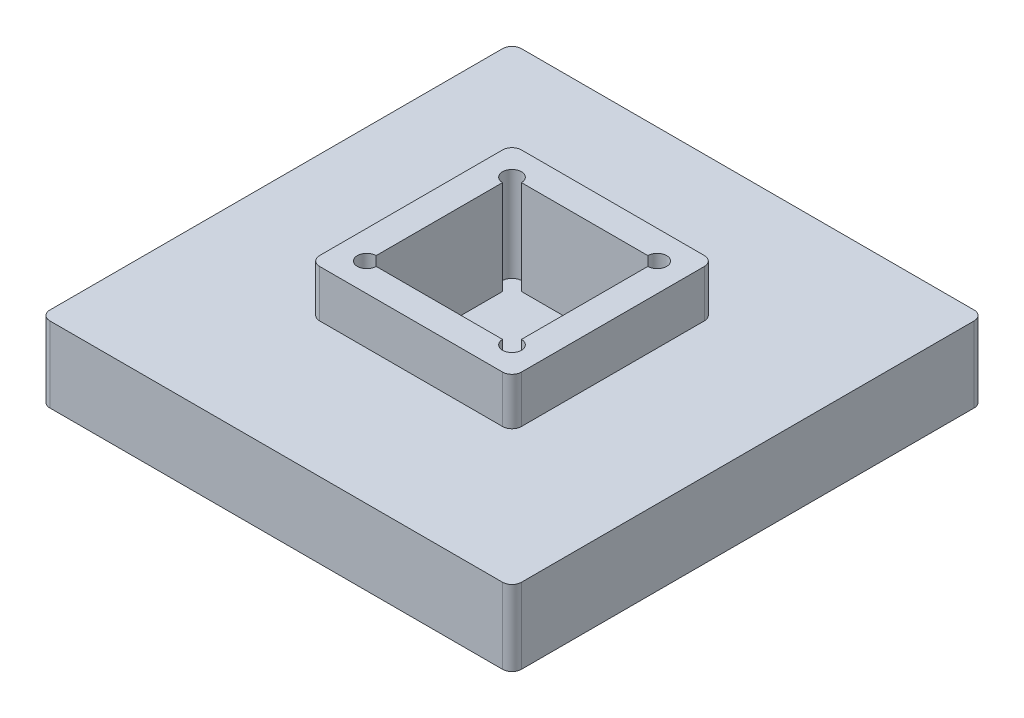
from build123d import *
from build123d.topology import SkipClean

# Parameters (mm, degrees)
SKETCH_1_W          = 50
SKETCH_1_H          = 50
EXTRUDE_1_DEPTH     = 8
SKETCH_2_W          = 21.4
SKETCH_2_H          = 21.4
EXTRUDE_2_DEPTH     = 5
FILLET_1_R          = 1
CUT_EXTRUDE_START   = -5
CUT_EXTRUDE_1_DEPTH = 5


with BuildPart() as part:
    # Sketch 1 → Extrude 1 (new body)
    with BuildSketch(Plane(origin=(0, 0, 0), x_dir=(1, 0, 0), z_dir=(0, 1, 0))):
        Rectangle(SKETCH_1_W, SKETCH_1_H)
    extrude(amount=EXTRUDE_1_DEPTH)

    # Sketch 2 → Extrude 2 (add)
    with BuildSketch(Plane(origin=(0, 8, 0), x_dir=(1, 0, 0), z_dir=(0, 1, 0))):
        Rectangle(SKETCH_2_W, SKETCH_2_H)
        with BuildLine():
            Line((6.7, -7.7), (-6.7, -7.7))
            ThreePointArc((-6.7, -7.7), (-8.407106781, -8.407106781), (-7.7, -6.7))
            Line((-7.7, -6.7), (-7.7, 6.7))
            ThreePointArc((-7.7, 6.7), (-8.407106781, 8.407106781), (-6.7, 7.7))
            Line((-6.7, 7.7), (6.7, 7.7))
            ThreePointArc((6.7, 7.7), (7.7, 8.7), (8.7, 7.7))
            ThreePointArc((8.7, 7.7), (8.407106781, 6.992893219), (7.7, 6.7))
            Line((7.7, 6.7), (7.7, -6.7))
            ThreePointArc((7.7, -6.7), (8.407106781, -6.992893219), (8.7, -7.7))
            ThreePointArc((8.7, -7.7), (7.7, -8.7), (6.7, -7.7))
        make_face(mode=Mode.SUBTRACT)
    extrude(amount=EXTRUDE_2_DEPTH)

    # Fillet 1
    fillet_1_edges = [part.edges().sort_by_distance(p)[0] for p in [
        (-10.7, 10.5, 10.7),
        (10.7, 10.5, 10.7),
        (10.7, 10.5, -10.7),
        (-10.7, 10.5, -10.7),
        (25, 4, 25),
        (-25, 4, 25),
        (-25, 4, -25),
        (25, 4, -25),
    ]]
    fillet(fillet_1_edges, radius=FILLET_1_R)

    # Sketch 3 → Cut-Extrude 1 (cut)
    with SkipClean():  # the faces are left unmerged after this step: merging them gives an invalid solid
        with BuildSketch(Plane(origin=(0, 8, 0), x_dir=(1, 0, 0), z_dir=(0, 1, 0)).offset(CUT_EXTRUDE_START)):
            with BuildLine():
                Line((-7.7, 6.7), (-7.7, -6.7))
                ThreePointArc((-7.7, -6.7), (-8.407106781, -8.407106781), (-6.7, -7.7))
                Line((-6.7, -7.7), (6.7, -7.7))
                ThreePointArc((6.7, -7.7), (8.407106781, -8.407106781), (7.7, -6.7))
                Line((7.7, -6.7), (7.7, 6.7))
                ThreePointArc((7.7, 6.7), (8.407106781, 8.407106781), (6.7, 7.7))
                Line((6.7, 7.7), (-6.7, 7.7))
                ThreePointArc((-6.7, 7.7), (-8.407106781, 8.407106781), (-7.7, 6.7))
            make_face()
        extrude(amount=CUT_EXTRUDE_1_DEPTH, mode=Mode.SUBTRACT)


solid = part.part
